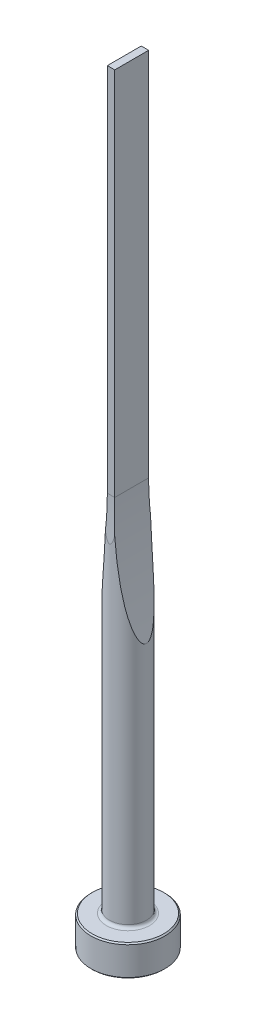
from build123d import *

# Parameters (mm, degrees)
CUT_EXTRUDE1_DEPTH = 5
CUT_EXTRUDE2_DEPTH = 5


with BuildPart() as part:
    # Sketch1 → Revolve1 (revolve)
    with BuildSketch(Plane.XY, mode=Mode.PRIVATE) as revolve1_sk:
        with BuildLine():
            Line((0, 0), (5.8, 0))
            Line((5.8, 0), (6, 0.2))
            Line((6, 0.2), (6, 4.8))
            Line((6, 4.8), (5.8, 5))
            Line((5.8, 5), (3.5, 5))
            ThreePointArc((3.5, 5), (3.146446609, 5.146446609), (3, 5.5))
            Line((3, 5.5), (3, 125))
            Line((3, 125), (0, 125))
            Line((0, 125), (0, 0))
        make_face()
    revolve(revolve1_sk.sketch.rotate(Axis((0, 125, 0), (0, -1, 0)), 180), axis=Axis((0, 125, 0), (0, -1, 0)))

    # Sketch2 → Cut-Extrude1 (cut, symmetric)
    with BuildSketch(Plane.XY):
        with BuildLine():
            Line((0.6, 125), (0.6, 65))
            ThreePointArc((0.6, 65), (1.202013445, 54.607695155), (3, 44.354419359))
            Line((3, 44.354419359), (3, 125))
            Line((3, 125), (0.6, 125))
        make_face()
        with BuildLine():
            Line((-0.6, 125), (-0.6, 65))
            ThreePointArc((-0.6, 65), (-1.202013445, 54.607695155), (-3, 44.354419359))
            Line((-3, 44.354419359), (-3, 125))
            Line((-3, 125), (-0.6, 125))
        make_face()
    extrude(amount=CUT_EXTRUDE1_DEPTH, both=True, mode=Mode.SUBTRACT)

    # Sketch3 → Cut-Extrude2 (cut, symmetric)
    with BuildSketch(Plane(origin=(0, 0, 0), x_dir=(0, 0, -1), z_dir=(1, 0, 0))):
        with BuildLine():
            Line((2.75, 125), (2.75, 65))
            ThreePointArc((2.75, 65), (2.812521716, 61.645898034), (3, 58.296456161))
            Line((3, 58.296456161), (3, 125))
            Line((3, 125), (2.75, 125))
        make_face()
        with BuildLine():
            Line((-2.75, 125), (-2.75, 65))
            ThreePointArc((-2.75, 65), (-2.812521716, 61.645898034), (-3, 58.296456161))
            Line((-3, 58.296456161), (-3, 125))
            Line((-3, 125), (-2.75, 125))
        make_face()
    extrude(amount=CUT_EXTRUDE2_DEPTH, both=True, mode=Mode.SUBTRACT)


solid = part.part
